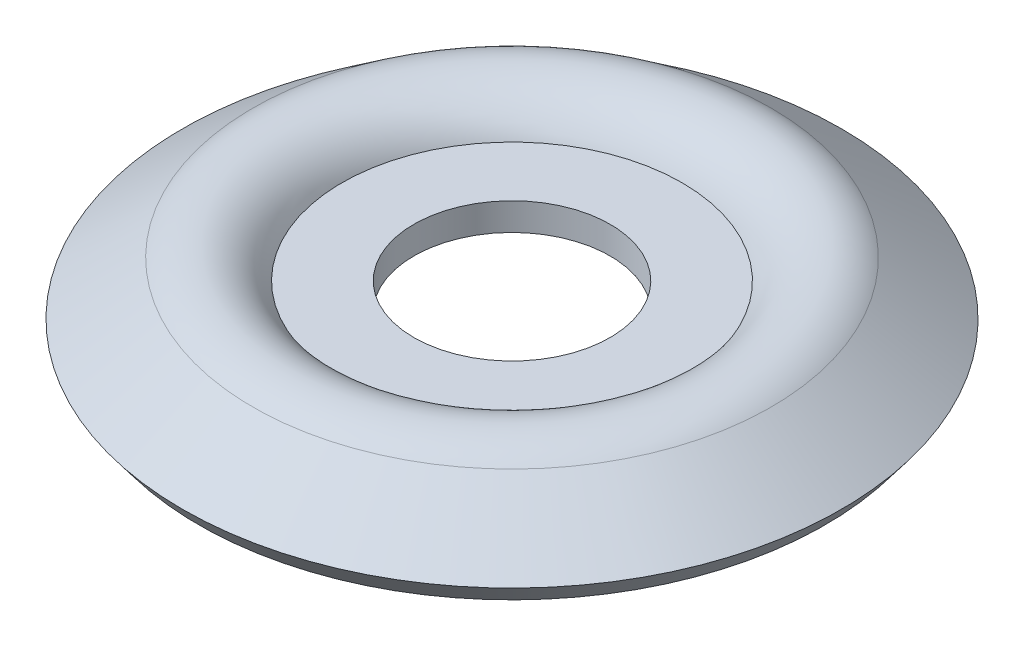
from build123d import *

# Parameters (mm, degrees)
SKETCH2_R          = 9.0805
CUT_EXTRUDE1_DEPTH = 44.412396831


with BuildPart() as part:
    # Sketch1 → Revolve-Thin1 (revolve)
    with BuildSketch(Plane.XY, mode=Mode.PRIVATE) as revolve_thin1_sk:
        with BuildLine():
            Line((0, 0), (17.653, 0))
            ThreePointArc((17.653, 0), (19.30694003, 2.671488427), (22.435610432, 2.382024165))
            Line((22.435610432, 2.382024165), (28.956, -2.54))
            Line((28.956, -2.54), (30.486306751, -0.512745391))
            Line((30.486306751, -0.512745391), (23.965917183, 4.409278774))
            ThreePointArc((23.965917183, 4.409278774), (19.414505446, 5.387428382), (15.731534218, 2.54))
            Line((15.731534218, 2.54), (0, 2.54))
            Line((0, 2.54), (0, 0))
        make_face()
    revolve(revolve_thin1_sk.sketch.rotate(Axis((0, 0, 0), (0, 1, 0)), 90), axis=Axis((0, 0, 0), (0, 1, 0)))

    # Sketch2 → Cut-Extrude1 (cut, through all)
    with BuildSketch(Plane(origin=(0, 2.54, 0), x_dir=(-1, 0, 0), z_dir=(0, 1, 0))):
        with Locations(Location((0, 0, 0), (0, 0, 90))):
            Circle(SKETCH2_R)
    extrude(amount=-CUT_EXTRUDE1_DEPTH, mode=Mode.SUBTRACT)


solid = part.part
